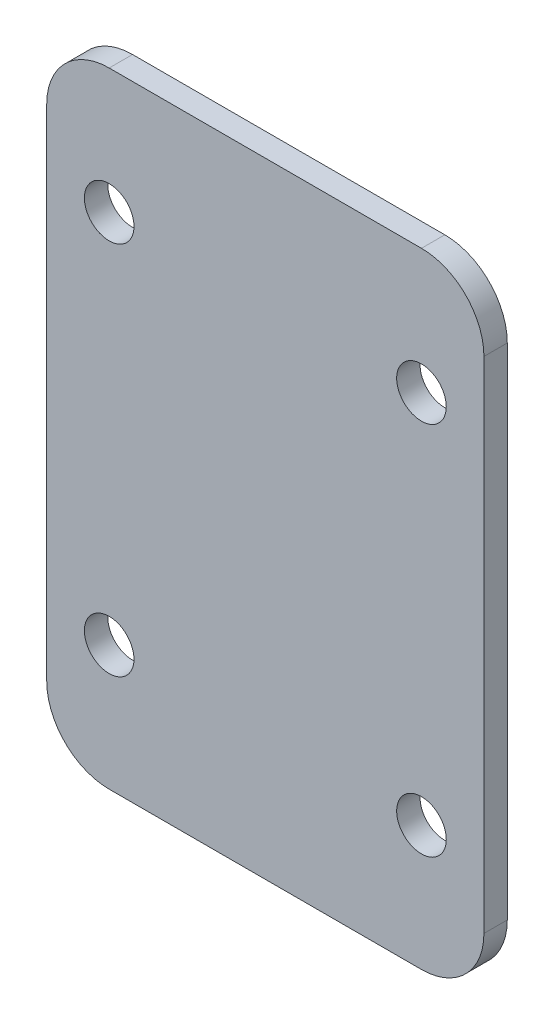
from build123d import *

# Parameters (mm, degrees)
SKETCH1_W          = 88.9
SKETCH1_H          = 127
BASE_EXTRUDE_DEPTH = 4.7498
SKETCH2_R          = 5.0419
MOUNTHOLES_DEPTH   = 4.7498
FILLET1_R          = 12.7


with BuildPart() as part:
    # Sketch1 → Base-Extrude (new body)
    with BuildSketch(Plane.XY):
        with Locations((44.45, 63.5)):
            Rectangle(SKETCH1_W, SKETCH1_H)
    extrude(amount=BASE_EXTRUDE_DEPTH)

    # Sketch2 → MountHoles (cut)
    with BuildSketch(Plane.XY.offset(4.7498)):
        with Locations((12.7, 101.6)):
            Circle(SKETCH2_R)
        with Locations((12.7, 25.4)):
            Circle(SKETCH2_R)
        with Locations((76.2, 25.4)):
            Circle(SKETCH2_R)
        with Locations((76.2, 101.6)):
            Circle(SKETCH2_R)
    extrude(amount=-MOUNTHOLES_DEPTH, mode=Mode.SUBTRACT)

    # Fillet1
    fillet1_edges = [part.edges().sort_by_distance(p)[0] for p in [
        (0, 0, 2.3749),
        (88.9, 0, 2.3749),
        (0, 127, 2.3749),
        (88.9, 127, 2.3749),
    ]]
    fillet(fillet1_edges, radius=FILLET1_R)


solid = part.part
